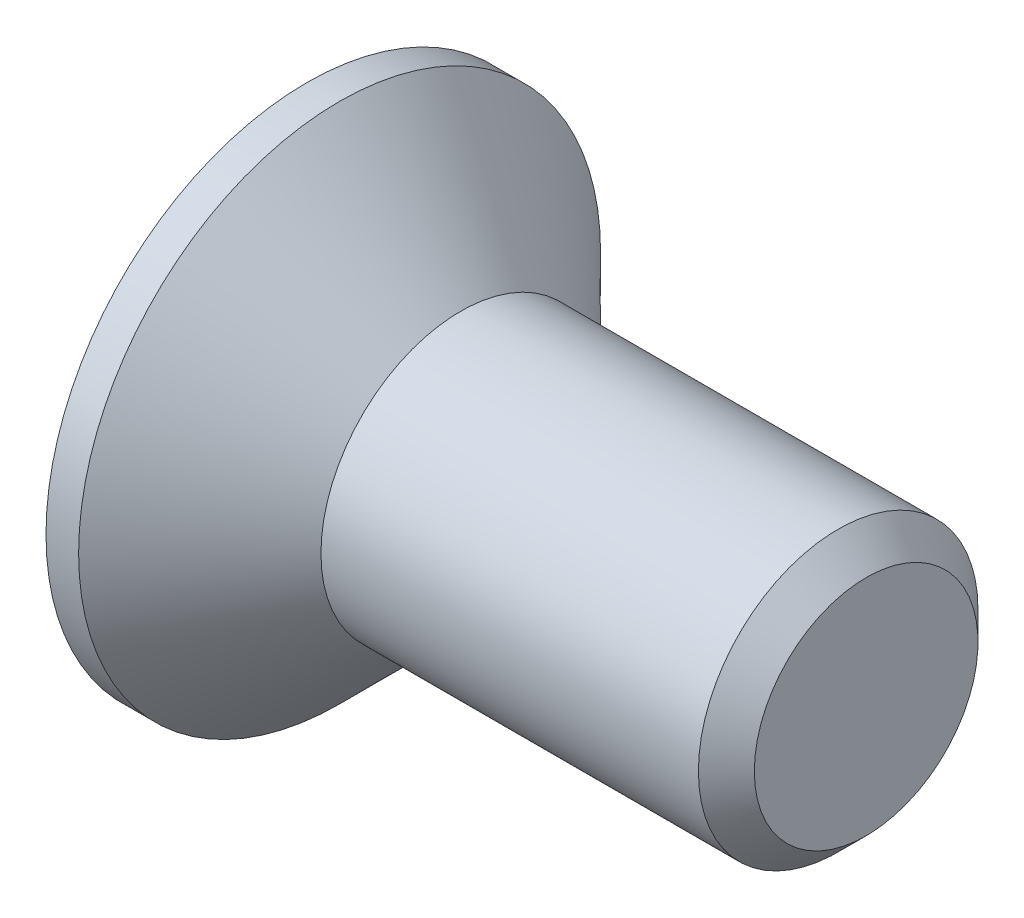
ISO-10303-21;
HEADER;
FILE_DESCRIPTION(('STEP AP214'),'2;1');
FILE_NAME('part.step','',(''),(''),'','','');
FILE_SCHEMA(('AUTOMOTIVE_DESIGN { 1 0 10303 214 1 1 1 1 }'));
ENDSEC;
DATA;
#1=APPLICATION_CONTEXT('core data for automotive mechanical design processes');
#2=APPLICATION_PROTOCOL_DEFINITION('international standard','automotive_design',2000,#1);
#3=PRODUCT_CONTEXT('',#1,'mechanical');
#4=PRODUCT('Part','Part','',(#3));
#5=PRODUCT_RELATED_PRODUCT_CATEGORY('part','',(#4));
#6=PRODUCT_DEFINITION_FORMATION('','',#4);
#7=PRODUCT_DEFINITION_CONTEXT('part definition',#1,'design');
#8=PRODUCT_DEFINITION('design','',#6,#7);
#9=PRODUCT_DEFINITION_SHAPE('','',#8);
#10=(LENGTH_UNIT() NAMED_UNIT(*) SI_UNIT(.MILLI.,.METRE.));
#11=(NAMED_UNIT(*) PLANE_ANGLE_UNIT() SI_UNIT($,.RADIAN.));
#12=(NAMED_UNIT(*) SI_UNIT($,.STERADIAN.) SOLID_ANGLE_UNIT());
#13=UNCERTAINTY_MEASURE_WITH_UNIT(LENGTH_MEASURE(1.E-05),#10,'distance_accuracy_value','');
#14=(GEOMETRIC_REPRESENTATION_CONTEXT(3) GLOBAL_UNCERTAINTY_ASSIGNED_CONTEXT((#13)) GLOBAL_UNIT_ASSIGNED_CONTEXT((#10,
#11,#12)) REPRESENTATION_CONTEXT('',''));
#15=CARTESIAN_POINT('',(0.,0.,0.));
#16=DIRECTION('',(0.,0.,1.));
#17=DIRECTION('',(1.,0.,0.));
#18=AXIS2_PLACEMENT_3D('',#15,#16,#17);
#19=CARTESIAN_POINT('',(0.,0.,0.));
#20=DIRECTION('',(-1.,0.,0.));
#21=DIRECTION('',(0.,0.,1.));
#22=AXIS2_PLACEMENT_3D('',#19,#20,#21);
#23=CONICAL_SURFACE('',#22,1.5,0.78539816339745);
#24=CARTESIAN_POINT('',(-1.3,0.,0.));
#25=DIRECTION('',(-1.,0.,0.));
#26=DIRECTION('',(0.,0.,1.));
#27=AXIS2_PLACEMENT_3D('',#24,#25,#26);
#28=CIRCLE('',#27,2.8);
#29=CARTESIAN_POINT('',(-1.3,0.,2.8));
#30=VERTEX_POINT('',#29);
#31=EDGE_CURVE('E189',#30,#30,#28,.T.);
#32=ORIENTED_EDGE('',*,*,#31,.F.);
#33=EDGE_LOOP('',(#32));
#34=FACE_BOUND('',#33,.T.);
#35=CARTESIAN_POINT('',(0.,0.,0.));
#36=DIRECTION('',(-1.,0.,0.));
#37=DIRECTION('',(0.,0.,1.));
#38=AXIS2_PLACEMENT_3D('',#35,#36,#37);
#39=CIRCLE('',#38,1.5);
#40=CARTESIAN_POINT('',(0.,0.,1.5));
#41=VERTEX_POINT('',#40);
#42=EDGE_CURVE('E212',#41,#41,#39,.T.);
#43=ORIENTED_EDGE('',*,*,#42,.T.);
#44=EDGE_LOOP('',(#43));
#45=FACE_BOUND('',#44,.T.);
#46=ADVANCED_FACE('F33',(#34,#45),#23,.T.);
#47=CARTESIAN_POINT('',(-1.65,0.,0.));
#48=DIRECTION('',(-1.,0.,0.));
#49=DIRECTION('',(0.,0.,1.));
#50=AXIS2_PLACEMENT_3D('',#47,#48,#49);
#51=CYLINDRICAL_SURFACE('',#50,1.5);
#52=CARTESIAN_POINT('',(4.05,0.,0.));
#53=DIRECTION('',(-1.,0.,0.));
#54=DIRECTION('',(0.,0.,1.));
#55=AXIS2_PLACEMENT_3D('',#52,#53,#54);
#56=CIRCLE('',#55,1.5);
#57=CARTESIAN_POINT('',(4.05,0.,1.5));
#58=VERTEX_POINT('',#57);
#59=EDGE_CURVE('E41',#58,#58,#56,.T.);
#60=ORIENTED_EDGE('',*,*,#59,.T.);
#61=EDGE_LOOP('',(#60));
#62=FACE_BOUND('',#61,.T.);
#63=ORIENTED_EDGE('',*,*,#42,.F.);
#64=EDGE_LOOP('',(#63));
#65=FACE_BOUND('',#64,.T.);
#66=ADVANCED_FACE('F217',(#62,#65),#51,.T.);
#67=CARTESIAN_POINT('',(4.35,0.,0.));
#68=DIRECTION('',(-1.,0.,0.));
#69=DIRECTION('',(0.,0.,1.));
#70=AXIS2_PLACEMENT_3D('',#67,#68,#69);
#71=PLANE('',#70);
#72=CARTESIAN_POINT('',(4.35,0.,0.));
#73=DIRECTION('',(-1.,0.,0.));
#74=DIRECTION('',(0.,0.,1.));
#75=AXIS2_PLACEMENT_3D('',#72,#73,#74);
#76=CIRCLE('',#75,1.2);
#77=CARTESIAN_POINT('',(4.35,0.,1.2));
#78=VERTEX_POINT('',#77);
#79=EDGE_CURVE('E11',#78,#78,#76,.F.);
#80=ORIENTED_EDGE('',*,*,#79,.T.);
#81=EDGE_LOOP('',(#80));
#82=FACE_BOUND('',#81,.T.);
#83=ADVANCED_FACE('F239',(#82),#71,.F.);
#84=CARTESIAN_POINT('',(-1.65,2.8,0.));
#85=DIRECTION('',(1.,0.,0.));
#86=DIRECTION('',(0.,0.,-1.));
#87=AXIS2_PLACEMENT_3D('',#84,#85,#86);
#88=PLANE('',#87);
#89=DIRECTION('',(0.,0.,-1.));
#90=VECTOR('',#89,1.);
#91=CARTESIAN_POINT('',(-1.65,0.365,-1.45));
#92=LINE('',#91,#90);
#93=CARTESIAN_POINT('',(-1.65,0.365,-0.365));
#94=VERTEX_POINT('',#93);
#95=CARTESIAN_POINT('',(-1.65,0.365,-1.45));
#96=VERTEX_POINT('',#95);
#97=EDGE_CURVE('E158',#94,#96,#92,.T.);
#98=ORIENTED_EDGE('',*,*,#97,.F.);
#99=DIRECTION('',(0.,-1.,0.));
#100=VECTOR('',#99,1.);
#101=CARTESIAN_POINT('',(-1.65,0.365,-0.365));
#102=LINE('',#101,#100);
#103=CARTESIAN_POINT('',(-1.65,1.45,-0.365));
#104=VERTEX_POINT('',#103);
#105=EDGE_CURVE('E48',#104,#94,#102,.T.);
#106=ORIENTED_EDGE('',*,*,#105,.F.);
#107=DIRECTION('',(0.,0.,-1.));
#108=VECTOR('',#107,1.);
#109=CARTESIAN_POINT('',(-1.65,1.45,-0.365));
#110=LINE('',#109,#108);
#111=CARTESIAN_POINT('',(-1.65,1.45,0.365));
#112=VERTEX_POINT('',#111);
#113=EDGE_CURVE('E185',#112,#104,#110,.T.);
#114=ORIENTED_EDGE('',*,*,#113,.F.);
#115=DIRECTION('',(0.,1.,0.));
#116=VECTOR('',#115,1.);
#117=CARTESIAN_POINT('',(-1.65,1.45,0.365));
#118=LINE('',#117,#116);
#119=CARTESIAN_POINT('',(-1.65,0.365,0.365));
#120=VERTEX_POINT('',#119);
#121=EDGE_CURVE('E183',#120,#112,#118,.T.);
#122=ORIENTED_EDGE('',*,*,#121,.F.);
#123=DIRECTION('',(0.,0.,-1.));
#124=VECTOR('',#123,1.);
#125=CARTESIAN_POINT('',(-1.65,0.365,0.365));
#126=LINE('',#125,#124);
#127=CARTESIAN_POINT('',(-1.65,0.365,1.45));
#128=VERTEX_POINT('',#127);
#129=EDGE_CURVE('E132',#128,#120,#126,.T.);
#130=ORIENTED_EDGE('',*,*,#129,.F.);
#131=DIRECTION('',(0.,1.,0.));
#132=VECTOR('',#131,1.);
#133=CARTESIAN_POINT('',(-1.65,0.365,1.45));
#134=LINE('',#133,#132);
#135=CARTESIAN_POINT('',(-1.65,-0.365,1.45));
#136=VERTEX_POINT('',#135);
#137=EDGE_CURVE('E179',#136,#128,#134,.T.);
#138=ORIENTED_EDGE('',*,*,#137,.F.);
#139=DIRECTION('',(0.,0.,1.));
#140=VECTOR('',#139,1.);
#141=CARTESIAN_POINT('',(-1.65,-0.365,1.45));
#142=LINE('',#141,#140);
#143=CARTESIAN_POINT('',(-1.65,-0.365,0.365));
#144=VERTEX_POINT('',#143);
#145=EDGE_CURVE('E176',#144,#136,#142,.T.);
#146=ORIENTED_EDGE('',*,*,#145,.F.);
#147=DIRECTION('',(0.,1.,0.));
#148=VECTOR('',#147,1.);
#149=CARTESIAN_POINT('',(-1.65,-0.365,0.365));
#150=LINE('',#149,#148);
#151=CARTESIAN_POINT('',(-1.65,-1.45,0.365));
#152=VERTEX_POINT('',#151);
#153=EDGE_CURVE('E173',#152,#144,#150,.T.);
#154=ORIENTED_EDGE('',*,*,#153,.F.);
#155=DIRECTION('',(0.,0.,1.));
#156=VECTOR('',#155,1.);
#157=CARTESIAN_POINT('',(-1.65,-1.45,0.365));
#158=LINE('',#157,#156);
#159=CARTESIAN_POINT('',(-1.65,-1.45,-0.365));
#160=VERTEX_POINT('',#159);
#161=EDGE_CURVE('E170',#160,#152,#158,.T.);
#162=ORIENTED_EDGE('',*,*,#161,.F.);
#163=DIRECTION('',(0.,-1.,0.));
#164=VECTOR('',#163,1.);
#165=CARTESIAN_POINT('',(-1.65,-1.45,-0.365));
#166=LINE('',#165,#164);
#167=CARTESIAN_POINT('',(-1.65,-0.365,-0.365));
#168=VERTEX_POINT('',#167);
#169=EDGE_CURVE('E167',#168,#160,#166,.T.);
#170=ORIENTED_EDGE('',*,*,#169,.F.);
#171=DIRECTION('',(0.,0.,1.));
#172=VECTOR('',#171,1.);
#173=CARTESIAN_POINT('',(-1.65,-0.365,-0.365));
#174=LINE('',#173,#172);
#175=CARTESIAN_POINT('',(-1.65,-0.365,-1.45));
#176=VERTEX_POINT('',#175);
#177=EDGE_CURVE('E164',#176,#168,#174,.T.);
#178=ORIENTED_EDGE('',*,*,#177,.F.);
#179=DIRECTION('',(0.,-1.,0.));
#180=VECTOR('',#179,1.);
#181=CARTESIAN_POINT('',(-1.65,-0.365,-1.45));
#182=LINE('',#181,#180);
#183=EDGE_CURVE('E161',#96,#176,#182,.T.);
#184=ORIENTED_EDGE('',*,*,#183,.F.);
#185=EDGE_LOOP('',(#98,#106,#114,#122,#130,#138,#146,#154,#162,#170,#178,#184));
#186=FACE_BOUND('',#185,.T.);
#187=CARTESIAN_POINT('',(-1.65,0.,0.));
#188=DIRECTION('',(-1.,0.,0.));
#189=DIRECTION('',(0.,0.,1.));
#190=AXIS2_PLACEMENT_3D('',#187,#188,#189);
#191=CIRCLE('',#190,2.8);
#192=CARTESIAN_POINT('',(-1.65,0.,2.8));
#193=VERTEX_POINT('',#192);
#194=EDGE_CURVE('E209',#193,#193,#191,.T.);
#195=ORIENTED_EDGE('',*,*,#194,.T.);
#196=EDGE_LOOP('',(#195));
#197=FACE_BOUND('',#196,.T.);
#198=ADVANCED_FACE('F230',(#186,#197),#88,.F.);
#199=CARTESIAN_POINT('',(-1.65,0.,0.));
#200=DIRECTION('',(-1.,0.,0.));
#201=DIRECTION('',(0.,0.,1.));
#202=AXIS2_PLACEMENT_3D('',#199,#200,#201);
#203=CYLINDRICAL_SURFACE('',#202,2.8);
#204=ORIENTED_EDGE('',*,*,#194,.F.);
#205=EDGE_LOOP('',(#204));
#206=FACE_BOUND('',#205,.T.);
#207=ORIENTED_EDGE('',*,*,#31,.T.);
#208=EDGE_LOOP('',(#207));
#209=FACE_BOUND('',#208,.T.);
#210=ADVANCED_FACE('F222',(#206,#209),#203,.T.);
#211=CARTESIAN_POINT('',(4.05,0.,0.));
#212=DIRECTION('',(-1.,0.,0.));
#213=DIRECTION('',(0.,0.,1.));
#214=AXIS2_PLACEMENT_3D('',#211,#212,#213);
#215=CONICAL_SURFACE('',#214,1.5,0.78539816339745);
#216=ORIENTED_EDGE('',*,*,#79,.F.);
#217=EDGE_LOOP('',(#216));
#218=FACE_BOUND('',#217,.T.);
#219=ORIENTED_EDGE('',*,*,#59,.F.);
#220=EDGE_LOOP('',(#219));
#221=FACE_BOUND('',#220,.T.);
#222=ADVANCED_FACE('F35',(#218,#221),#215,.T.);
#223=CARTESIAN_POINT('',(-0.4,0.365,-0.365));
#224=DIRECTION('',(0.,0.,-1.));
#225=DIRECTION('',(-1.,0.,0.));
#226=AXIS2_PLACEMENT_3D('',#223,#224,#225);
#227=PLANE('',#226);
#228=ORIENTED_EDGE('',*,*,#105,.T.);
#229=DIRECTION('',(-1.,0.,0.));
#230=VECTOR('',#229,1.);
#231=CARTESIAN_POINT('',(-0.4,0.365,-0.365));
#232=LINE('',#231,#230);
#233=CARTESIAN_POINT('',(-0.4,0.365,-0.365));
#234=VERTEX_POINT('',#233);
#235=EDGE_CURVE('E96',#234,#94,#232,.T.);
#236=ORIENTED_EDGE('',*,*,#235,.F.);
#237=DIRECTION('',(0.,-1.,0.));
#238=VECTOR('',#237,1.);
#239=CARTESIAN_POINT('',(-0.4,0.365,-0.365));
#240=LINE('',#239,#238);
#241=CARTESIAN_POINT('',(-0.4,1.45,-0.365));
#242=VERTEX_POINT('',#241);
#243=EDGE_CURVE('E187',#242,#234,#240,.T.);
#244=ORIENTED_EDGE('',*,*,#243,.F.);
#245=DIRECTION('',(-1.,0.,0.));
#246=VECTOR('',#245,1.);
#247=CARTESIAN_POINT('',(-0.4,1.45,-0.365));
#248=LINE('',#247,#246);
#249=EDGE_CURVE('E56',#242,#104,#248,.T.);
#250=ORIENTED_EDGE('',*,*,#249,.T.);
#251=EDGE_LOOP('',(#228,#236,#244,#250));
#252=FACE_BOUND('',#251,.T.);
#253=ADVANCED_FACE('F221',(#252),#227,.F.);
#254=CARTESIAN_POINT('',(-0.4,1.45,-0.365));
#255=DIRECTION('',(0.,1.,0.));
#256=DIRECTION('',(-1.,0.,0.));
#257=AXIS2_PLACEMENT_3D('',#254,#255,#256);
#258=PLANE('',#257);
#259=ORIENTED_EDGE('',*,*,#113,.T.);
#260=ORIENTED_EDGE('',*,*,#249,.F.);
#261=DIRECTION('',(0.,0.,-1.));
#262=VECTOR('',#261,1.);
#263=CARTESIAN_POINT('',(-0.4,1.45,-0.365));
#264=LINE('',#263,#262);
#265=CARTESIAN_POINT('',(-0.4,1.45,0.365));
#266=VERTEX_POINT('',#265);
#267=EDGE_CURVE('E144',#266,#242,#264,.T.);
#268=ORIENTED_EDGE('',*,*,#267,.F.);
#269=DIRECTION('',(-1.,0.,0.));
#270=VECTOR('',#269,1.);
#271=CARTESIAN_POINT('',(-0.4,1.45,0.365));
#272=LINE('',#271,#270);
#273=EDGE_CURVE('E136',#266,#112,#272,.T.);
#274=ORIENTED_EDGE('',*,*,#273,.T.);
#275=EDGE_LOOP('',(#259,#260,#268,#274));
#276=FACE_BOUND('',#275,.T.);
#277=ADVANCED_FACE('F228',(#276),#258,.F.);
#278=CARTESIAN_POINT('',(-0.4,1.45,0.365));
#279=DIRECTION('',(0.,0.,1.));
#280=DIRECTION('',(1.,0.,0.));
#281=AXIS2_PLACEMENT_3D('',#278,#279,#280);
#282=PLANE('',#281);
#283=ORIENTED_EDGE('',*,*,#121,.T.);
#284=ORIENTED_EDGE('',*,*,#273,.F.);
#285=DIRECTION('',(0.,1.,0.));
#286=VECTOR('',#285,1.);
#287=CARTESIAN_POINT('',(-0.4,1.45,0.365));
#288=LINE('',#287,#286);
#289=CARTESIAN_POINT('',(-0.4,0.365,0.365));
#290=VERTEX_POINT('',#289);
#291=EDGE_CURVE('E140',#290,#266,#288,.T.);
#292=ORIENTED_EDGE('',*,*,#291,.F.);
#293=DIRECTION('',(-1.,0.,0.));
#294=VECTOR('',#293,1.);
#295=CARTESIAN_POINT('',(-0.4,0.365,0.365));
#296=LINE('',#295,#294);
#297=EDGE_CURVE('E125',#290,#120,#296,.T.);
#298=ORIENTED_EDGE('',*,*,#297,.T.);
#299=EDGE_LOOP('',(#283,#284,#292,#298));
#300=FACE_BOUND('',#299,.T.);
#301=ADVANCED_FACE('F141',(#300),#282,.F.);
#302=CARTESIAN_POINT('',(-0.4,0.365,0.365));
#303=DIRECTION('',(0.,1.,0.));
#304=DIRECTION('',(-1.,0.,0.));
#305=AXIS2_PLACEMENT_3D('',#302,#303,#304);
#306=PLANE('',#305);
#307=ORIENTED_EDGE('',*,*,#129,.T.);
#308=ORIENTED_EDGE('',*,*,#297,.F.);
#309=DIRECTION('',(0.,0.,-1.));
#310=VECTOR('',#309,1.);
#311=CARTESIAN_POINT('',(-0.4,0.365,0.365));
#312=LINE('',#311,#310);
#313=CARTESIAN_POINT('',(-0.4,0.365,1.45));
#314=VERTEX_POINT('',#313);
#315=EDGE_CURVE('E129',#314,#290,#312,.T.);
#316=ORIENTED_EDGE('',*,*,#315,.F.);
#317=DIRECTION('',(-1.,0.,0.));
#318=VECTOR('',#317,1.);
#319=CARTESIAN_POINT('',(-0.4,0.365,1.45));
#320=LINE('',#319,#318);
#321=EDGE_CURVE('E137',#314,#128,#320,.T.);
#322=ORIENTED_EDGE('',*,*,#321,.T.);
#323=EDGE_LOOP('',(#307,#308,#316,#322));
#324=FACE_BOUND('',#323,.T.);
#325=ADVANCED_FACE('F127',(#324),#306,.F.);
#326=CARTESIAN_POINT('',(-0.4,0.365,1.45));
#327=DIRECTION('',(0.,0.,1.));
#328=DIRECTION('',(1.,0.,0.));
#329=AXIS2_PLACEMENT_3D('',#326,#327,#328);
#330=PLANE('',#329);
#331=ORIENTED_EDGE('',*,*,#137,.T.);
#332=ORIENTED_EDGE('',*,*,#321,.F.);
#333=DIRECTION('',(0.,1.,0.));
#334=VECTOR('',#333,1.);
#335=CARTESIAN_POINT('',(-0.4,0.365,1.45));
#336=LINE('',#335,#334);
#337=CARTESIAN_POINT('',(-0.4,-0.365,1.45));
#338=VERTEX_POINT('',#337);
#339=EDGE_CURVE('E150',#338,#314,#336,.T.);
#340=ORIENTED_EDGE('',*,*,#339,.F.);
#341=DIRECTION('',(-1.,0.,0.));
#342=VECTOR('',#341,1.);
#343=CARTESIAN_POINT('',(-0.4,-0.365,1.45));
#344=LINE('',#343,#342);
#345=EDGE_CURVE('E192',#338,#136,#344,.T.);
#346=ORIENTED_EDGE('',*,*,#345,.T.);
#347=EDGE_LOOP('',(#331,#332,#340,#346));
#348=FACE_BOUND('',#347,.T.);
#349=ADVANCED_FACE('F277',(#348),#330,.F.);
#350=CARTESIAN_POINT('',(-0.4,-0.365,1.45));
#351=DIRECTION('',(0.,-1.,0.));
#352=DIRECTION('',(1.,0.,0.));
#353=AXIS2_PLACEMENT_3D('',#350,#351,#352);
#354=PLANE('',#353);
#355=ORIENTED_EDGE('',*,*,#145,.T.);
#356=ORIENTED_EDGE('',*,*,#345,.F.);
#357=DIRECTION('',(0.,0.,1.));
#358=VECTOR('',#357,1.);
#359=CARTESIAN_POINT('',(-0.4,-0.365,1.45));
#360=LINE('',#359,#358);
#361=CARTESIAN_POINT('',(-0.4,-0.365,0.365));
#362=VERTEX_POINT('',#361);
#363=EDGE_CURVE('E152',#362,#338,#360,.T.);
#364=ORIENTED_EDGE('',*,*,#363,.F.);
#365=DIRECTION('',(-1.,0.,0.));
#366=VECTOR('',#365,1.);
#367=CARTESIAN_POINT('',(-0.4,-0.365,0.365));
#368=LINE('',#367,#366);
#369=EDGE_CURVE('E194',#362,#144,#368,.T.);
#370=ORIENTED_EDGE('',*,*,#369,.T.);
#371=EDGE_LOOP('',(#355,#356,#364,#370));
#372=FACE_BOUND('',#371,.T.);
#373=ADVANCED_FACE('F273',(#372),#354,.F.);
#374=CARTESIAN_POINT('',(-0.4,-0.365,0.365));
#375=DIRECTION('',(0.,0.,1.));
#376=DIRECTION('',(1.,0.,0.));
#377=AXIS2_PLACEMENT_3D('',#374,#375,#376);
#378=PLANE('',#377);
#379=ORIENTED_EDGE('',*,*,#153,.T.);
#380=ORIENTED_EDGE('',*,*,#369,.F.);
#381=DIRECTION('',(0.,1.,0.));
#382=VECTOR('',#381,1.);
#383=CARTESIAN_POINT('',(-0.4,-0.365,0.365));
#384=LINE('',#383,#382);
#385=CARTESIAN_POINT('',(-0.4,-1.45,0.365));
#386=VERTEX_POINT('',#385);
#387=EDGE_CURVE('E422',#386,#362,#384,.T.);
#388=ORIENTED_EDGE('',*,*,#387,.F.);
#389=DIRECTION('',(-1.,0.,0.));
#390=VECTOR('',#389,1.);
#391=CARTESIAN_POINT('',(-0.4,-1.45,0.365));
#392=LINE('',#391,#390);
#393=EDGE_CURVE('E196',#386,#152,#392,.T.);
#394=ORIENTED_EDGE('',*,*,#393,.T.);
#395=EDGE_LOOP('',(#379,#380,#388,#394));
#396=FACE_BOUND('',#395,.T.);
#397=ADVANCED_FACE('F269',(#396),#378,.F.);
#398=CARTESIAN_POINT('',(-0.4,-1.45,0.365));
#399=DIRECTION('',(0.,-1.,0.));
#400=DIRECTION('',(1.,0.,0.));
#401=AXIS2_PLACEMENT_3D('',#398,#399,#400);
#402=PLANE('',#401);
#403=ORIENTED_EDGE('',*,*,#161,.T.);
#404=ORIENTED_EDGE('',*,*,#393,.F.);
#405=DIRECTION('',(0.,0.,1.));
#406=VECTOR('',#405,1.);
#407=CARTESIAN_POINT('',(-0.4,-1.45,0.365));
#408=LINE('',#407,#406);
#409=CARTESIAN_POINT('',(-0.4,-1.45,-0.365));
#410=VERTEX_POINT('',#409);
#411=EDGE_CURVE('E419',#410,#386,#408,.T.);
#412=ORIENTED_EDGE('',*,*,#411,.F.);
#413=DIRECTION('',(-1.,0.,0.));
#414=VECTOR('',#413,1.);
#415=CARTESIAN_POINT('',(-0.4,-1.45,-0.365));
#416=LINE('',#415,#414);
#417=EDGE_CURVE('E198',#410,#160,#416,.T.);
#418=ORIENTED_EDGE('',*,*,#417,.T.);
#419=EDGE_LOOP('',(#403,#404,#412,#418));
#420=FACE_BOUND('',#419,.T.);
#421=ADVANCED_FACE('F265',(#420),#402,.F.);
#422=CARTESIAN_POINT('',(-0.4,-1.45,-0.365));
#423=DIRECTION('',(0.,0.,-1.));
#424=DIRECTION('',(-1.,0.,0.));
#425=AXIS2_PLACEMENT_3D('',#422,#423,#424);
#426=PLANE('',#425);
#427=ORIENTED_EDGE('',*,*,#169,.T.);
#428=ORIENTED_EDGE('',*,*,#417,.F.);
#429=DIRECTION('',(0.,-1.,0.));
#430=VECTOR('',#429,1.);
#431=CARTESIAN_POINT('',(-0.4,-1.45,-0.365));
#432=LINE('',#431,#430);
#433=CARTESIAN_POINT('',(-0.4,-0.365,-0.365));
#434=VERTEX_POINT('',#433);
#435=EDGE_CURVE('E416',#434,#410,#432,.T.);
#436=ORIENTED_EDGE('',*,*,#435,.F.);
#437=DIRECTION('',(-1.,0.,0.));
#438=VECTOR('',#437,1.);
#439=CARTESIAN_POINT('',(-0.4,-0.365,-0.365));
#440=LINE('',#439,#438);
#441=EDGE_CURVE('E200',#434,#168,#440,.T.);
#442=ORIENTED_EDGE('',*,*,#441,.T.);
#443=EDGE_LOOP('',(#427,#428,#436,#442));
#444=FACE_BOUND('',#443,.T.);
#445=ADVANCED_FACE('F261',(#444),#426,.F.);
#446=CARTESIAN_POINT('',(-0.4,-0.365,-0.365));
#447=DIRECTION('',(0.,-1.,0.));
#448=DIRECTION('',(1.,0.,0.));
#449=AXIS2_PLACEMENT_3D('',#446,#447,#448);
#450=PLANE('',#449);
#451=ORIENTED_EDGE('',*,*,#177,.T.);
#452=ORIENTED_EDGE('',*,*,#441,.F.);
#453=DIRECTION('',(0.,0.,1.));
#454=VECTOR('',#453,1.);
#455=CARTESIAN_POINT('',(-0.4,-0.365,-0.365));
#456=LINE('',#455,#454);
#457=CARTESIAN_POINT('',(-0.4,-0.365,-1.45));
#458=VERTEX_POINT('',#457);
#459=EDGE_CURVE('E413',#458,#434,#456,.T.);
#460=ORIENTED_EDGE('',*,*,#459,.F.);
#461=DIRECTION('',(-1.,0.,0.));
#462=VECTOR('',#461,1.);
#463=CARTESIAN_POINT('',(-0.4,-0.365,-1.45));
#464=LINE('',#463,#462);
#465=EDGE_CURVE('E202',#458,#176,#464,.T.);
#466=ORIENTED_EDGE('',*,*,#465,.T.);
#467=EDGE_LOOP('',(#451,#452,#460,#466));
#468=FACE_BOUND('',#467,.T.);
#469=ADVANCED_FACE('F257',(#468),#450,.F.);
#470=CARTESIAN_POINT('',(-0.4,-0.365,-1.45));
#471=DIRECTION('',(0.,0.,-1.));
#472=DIRECTION('',(-1.,0.,0.));
#473=AXIS2_PLACEMENT_3D('',#470,#471,#472);
#474=PLANE('',#473);
#475=ORIENTED_EDGE('',*,*,#183,.T.);
#476=ORIENTED_EDGE('',*,*,#465,.F.);
#477=DIRECTION('',(0.,-1.,0.));
#478=VECTOR('',#477,1.);
#479=CARTESIAN_POINT('',(-0.4,-0.365,-1.45));
#480=LINE('',#479,#478);
#481=CARTESIAN_POINT('',(-0.4,0.365,-1.45));
#482=VERTEX_POINT('',#481);
#483=EDGE_CURVE('E408',#482,#458,#480,.T.);
#484=ORIENTED_EDGE('',*,*,#483,.F.);
#485=DIRECTION('',(-1.,0.,0.));
#486=VECTOR('',#485,1.);
#487=CARTESIAN_POINT('',(-0.4,0.365,-1.45));
#488=LINE('',#487,#486);
#489=EDGE_CURVE('E204',#482,#96,#488,.T.);
#490=ORIENTED_EDGE('',*,*,#489,.T.);
#491=EDGE_LOOP('',(#475,#476,#484,#490));
#492=FACE_BOUND('',#491,.T.);
#493=ADVANCED_FACE('F253',(#492),#474,.F.);
#494=CARTESIAN_POINT('',(-0.4,0.365,-1.45));
#495=DIRECTION('',(0.,1.,0.));
#496=DIRECTION('',(-1.,0.,0.));
#497=AXIS2_PLACEMENT_3D('',#494,#495,#496);
#498=PLANE('',#497);
#499=ORIENTED_EDGE('',*,*,#97,.T.);
#500=ORIENTED_EDGE('',*,*,#489,.F.);
#501=DIRECTION('',(0.,0.,-1.));
#502=VECTOR('',#501,1.);
#503=CARTESIAN_POINT('',(-0.4,0.365,-1.45));
#504=LINE('',#503,#502);
#505=EDGE_CURVE('E406',#234,#482,#504,.T.);
#506=ORIENTED_EDGE('',*,*,#505,.F.);
#507=ORIENTED_EDGE('',*,*,#235,.T.);
#508=EDGE_LOOP('',(#499,#500,#506,#507));
#509=FACE_BOUND('',#508,.T.);
#510=ADVANCED_FACE('F250',(#509),#498,.F.);
#511=CARTESIAN_POINT('',(-0.4,0.,0.));
#512=DIRECTION('',(1.,0.,0.));
#513=DIRECTION('',(0.,0.,-1.));
#514=AXIS2_PLACEMENT_3D('',#511,#512,#513);
#515=PLANE('',#514);
#516=ORIENTED_EDGE('',*,*,#243,.T.);
#517=ORIENTED_EDGE('',*,*,#505,.T.);
#518=ORIENTED_EDGE('',*,*,#483,.T.);
#519=ORIENTED_EDGE('',*,*,#459,.T.);
#520=ORIENTED_EDGE('',*,*,#435,.T.);
#521=ORIENTED_EDGE('',*,*,#411,.T.);
#522=ORIENTED_EDGE('',*,*,#387,.T.);
#523=ORIENTED_EDGE('',*,*,#363,.T.);
#524=ORIENTED_EDGE('',*,*,#339,.T.);
#525=ORIENTED_EDGE('',*,*,#315,.T.);
#526=ORIENTED_EDGE('',*,*,#291,.T.);
#527=ORIENTED_EDGE('',*,*,#267,.T.);
#528=EDGE_LOOP('',(#516,#517,#518,#519,#520,#521,#522,#523,#524,#525,#526,#527));
#529=FACE_BOUND('',#528,.T.);
#530=ADVANCED_FACE('F147',(#529),#515,.F.);
#531=CLOSED_SHELL('',(#46,#66,#83,#198,#210,#222,#253,#277,#301,#325,#349,#373,#397,#421,#445,
#469,#493,#510,#530));
#532=MANIFOLD_SOLID_BREP('B2',#531);
#533=ADVANCED_BREP_SHAPE_REPRESENTATION('',(#18,#532),#14);
#534=SHAPE_DEFINITION_REPRESENTATION(#9,#533);
ENDSEC;
END-ISO-10303-21;
